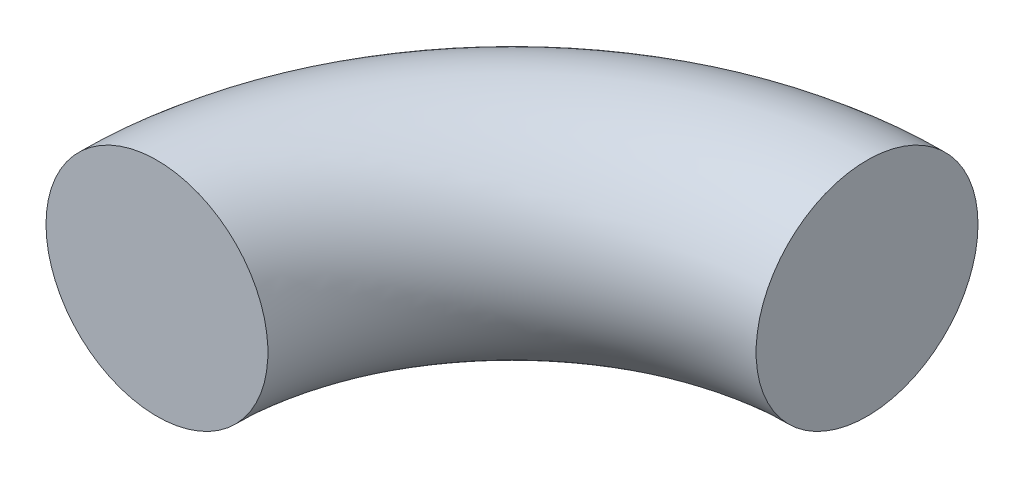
from build123d import *

# Parameters (mm, degrees)
SKETCH1_R      = 0.79375
REVOLVE1_ANGLE = 90


with BuildPart() as part:
    # Sketch1 → Revolve1 (revolve)
    with BuildSketch(Plane.XY):
        with Locations((-26.12409513, 12.639861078)):
            Circle(SKETCH1_R)
    revolve(axis=Axis((-23.58409513, 17.347967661, 0), (0, -1, 0)), revolution_arc=REVOLVE1_ANGLE)


solid = part.part
